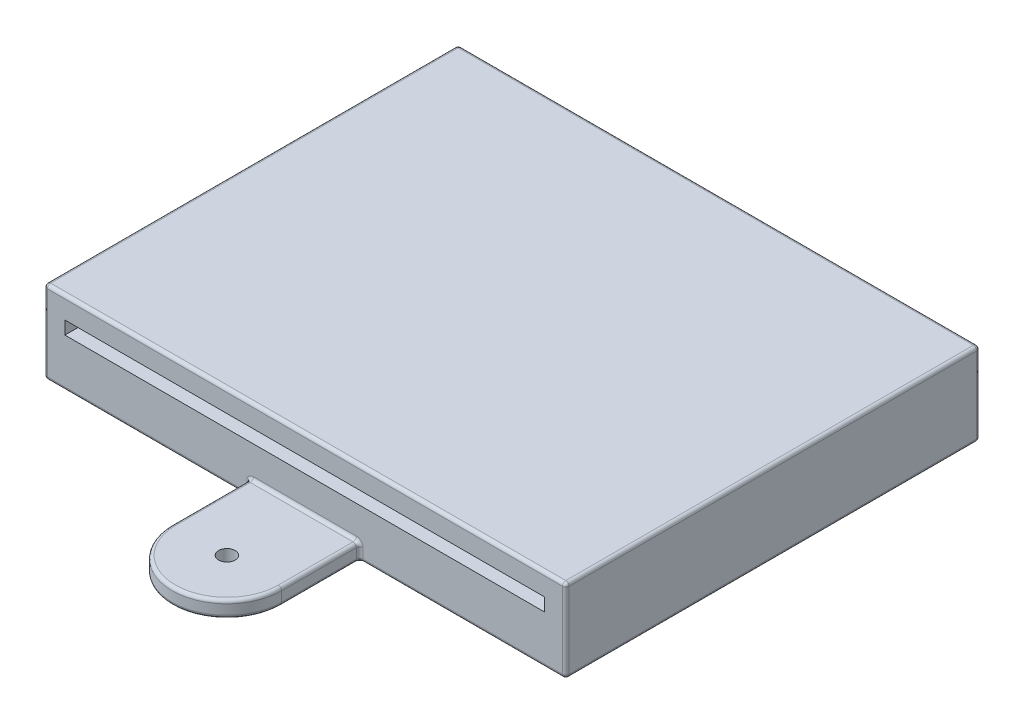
ISO-10303-21;
HEADER;
FILE_DESCRIPTION(('STEP AP214'),'2;1');
FILE_NAME('part.step','',(''),(''),'','','');
FILE_SCHEMA(('AUTOMOTIVE_DESIGN { 1 0 10303 214 1 1 1 1 }'));
ENDSEC;
DATA;
#1=APPLICATION_CONTEXT('core data for automotive mechanical design processes');
#2=APPLICATION_PROTOCOL_DEFINITION('international standard','automotive_design',2000,#1);
#3=PRODUCT_CONTEXT('',#1,'mechanical');
#4=PRODUCT('Part','Part','',(#3));
#5=PRODUCT_RELATED_PRODUCT_CATEGORY('part','',(#4));
#6=PRODUCT_DEFINITION_FORMATION('','',#4);
#7=PRODUCT_DEFINITION_CONTEXT('part definition',#1,'design');
#8=PRODUCT_DEFINITION('design','',#6,#7);
#9=PRODUCT_DEFINITION_SHAPE('','',#8);
#10=(LENGTH_UNIT() NAMED_UNIT(*) SI_UNIT(.MILLI.,.METRE.));
#11=(NAMED_UNIT(*) PLANE_ANGLE_UNIT() SI_UNIT($,.RADIAN.));
#12=(NAMED_UNIT(*) SI_UNIT($,.STERADIAN.) SOLID_ANGLE_UNIT());
#13=UNCERTAINTY_MEASURE_WITH_UNIT(LENGTH_MEASURE(1.E-05),#10,'distance_accuracy_value','');
#14=(GEOMETRIC_REPRESENTATION_CONTEXT(3) GLOBAL_UNCERTAINTY_ASSIGNED_CONTEXT((#13)) GLOBAL_UNIT_ASSIGNED_CONTEXT((#10,
#11,#12)) REPRESENTATION_CONTEXT('',''));
#15=CARTESIAN_POINT('',(0.,0.,0.));
#16=DIRECTION('',(0.,0.,1.));
#17=DIRECTION('',(1.,0.,0.));
#18=AXIS2_PLACEMENT_3D('',#15,#16,#17);
#19=CARTESIAN_POINT('',(-400.,127.,317.5));
#20=DIRECTION('',(0.,0.,-1.));
#21=DIRECTION('',(-1.,0.,0.));
#22=AXIS2_PLACEMENT_3D('',#19,#20,#21);
#23=PLANE('',#22);
#24=DIRECTION('',(0.,-1.,0.));
#25=VECTOR('',#24,1.);
#26=CARTESIAN_POINT('',(89.0769273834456,127.,317.5));
#27=LINE('',#26,#25);
#28=CARTESIAN_POINT('',(89.0769273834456,20.32,317.5));
#29=VERTEX_POINT('',#28);
#30=CARTESIAN_POINT('',(89.0769273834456,5.08,317.5));
#31=VERTEX_POINT('',#30);
#32=EDGE_CURVE('E287',#29,#31,#27,.T.);
#33=ORIENTED_EDGE('',*,*,#32,.T.);
#34=DIRECTION('',(1.,0.,0.));
#35=VECTOR('',#34,1.);
#36=CARTESIAN_POINT('',(400.,5.08,317.5));
#37=LINE('',#36,#35);
#38=CARTESIAN_POINT('',(394.92,5.08,317.5));
#39=VERTEX_POINT('',#38);
#40=EDGE_CURVE('E290',#31,#39,#37,.T.);
#41=ORIENTED_EDGE('',*,*,#40,.T.);
#42=DIRECTION('',(0.,-1.,0.));
#43=VECTOR('',#42,1.);
#44=CARTESIAN_POINT('',(394.92,127.,317.5));
#45=LINE('',#44,#43);
#46=CARTESIAN_POINT('',(394.92,121.92,317.5));
#47=VERTEX_POINT('',#46);
#48=EDGE_CURVE('E282',#39,#47,#45,.F.);
#49=ORIENTED_EDGE('',*,*,#48,.T.);
#50=DIRECTION('',(1.,0.,0.));
#51=VECTOR('',#50,1.);
#52=CARTESIAN_POINT('',(-400.,121.92,317.5));
#53=LINE('',#52,#51);
#54=CARTESIAN_POINT('',(-394.92,121.92,317.5));
#55=VERTEX_POINT('',#54);
#56=EDGE_CURVE('E278',#47,#55,#53,.F.);
#57=ORIENTED_EDGE('',*,*,#56,.T.);
#58=DIRECTION('',(0.,-1.,0.));
#59=VECTOR('',#58,1.);
#60=CARTESIAN_POINT('',(-394.92,127.,317.5));
#61=LINE('',#60,#59);
#62=CARTESIAN_POINT('',(-394.92,5.08,317.5));
#63=VERTEX_POINT('',#62);
#64=EDGE_CURVE('E276',#55,#63,#61,.T.);
#65=ORIENTED_EDGE('',*,*,#64,.T.);
#66=DIRECTION('',(1.,0.,0.));
#67=VECTOR('',#66,1.);
#68=CARTESIAN_POINT('',(-83.9969273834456,5.08,317.5));
#69=LINE('',#68,#67);
#70=CARTESIAN_POINT('',(-89.0769273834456,5.08,317.5));
#71=VERTEX_POINT('',#70);
#72=EDGE_CURVE('E274',#63,#71,#69,.T.);
#73=ORIENTED_EDGE('',*,*,#72,.T.);
#74=DIRECTION('',(0.,-1.,0.));
#75=VECTOR('',#74,1.);
#76=CARTESIAN_POINT('',(-89.0769273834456,127.,317.5));
#77=LINE('',#76,#75);
#78=CARTESIAN_POINT('',(-89.0769273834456,20.32,317.5));
#79=VERTEX_POINT('',#78);
#80=EDGE_CURVE('E272',#71,#79,#77,.F.);
#81=ORIENTED_EDGE('',*,*,#80,.T.);
#82=CARTESIAN_POINT('',(-78.9169273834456,20.32,317.5));
#83=DIRECTION('',(0.,0.,-1.));
#84=DIRECTION('',(-1.,0.,0.));
#85=AXIS2_PLACEMENT_3D('',#82,#83,#84);
#86=CIRCLE('',#85,10.16);
#87=CARTESIAN_POINT('',(-78.9169273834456,30.48,317.5));
#88=VERTEX_POINT('',#87);
#89=EDGE_CURVE('E264',#88,#79,#86,.F.);
#90=ORIENTED_EDGE('',*,*,#89,.F.);
#91=DIRECTION('',(1.,0.,0.));
#92=VECTOR('',#91,1.);
#93=CARTESIAN_POINT('',(-400.,30.48,317.5));
#94=LINE('',#93,#92);
#95=CARTESIAN_POINT('',(78.9169273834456,30.48,317.5));
#96=VERTEX_POINT('',#95);
#97=EDGE_CURVE('E280',#88,#96,#94,.T.);
#98=ORIENTED_EDGE('',*,*,#97,.T.);
#99=CARTESIAN_POINT('',(78.9169273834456,20.32,317.5));
#100=DIRECTION('',(0.,0.,-1.));
#101=DIRECTION('',(-1.,0.,0.));
#102=AXIS2_PLACEMENT_3D('',#99,#100,#101);
#103=CIRCLE('',#102,10.16);
#104=EDGE_CURVE('E284',#29,#96,#103,.F.);
#105=ORIENTED_EDGE('',*,*,#104,.F.);
#106=EDGE_LOOP('',(#33,#41,#49,#57,#65,#73,#81,#90,#98,#105));
#107=FACE_BOUND('',#106,.T.);
#108=DIRECTION('',(1.,0.,0.));
#109=VECTOR('',#108,1.);
#110=CARTESIAN_POINT('',(-368.,74.,317.5));
#111=LINE('',#110,#109);
#112=CARTESIAN_POINT('',(-368.,74.,317.5));
#113=VERTEX_POINT('',#112);
#114=CARTESIAN_POINT('',(367.,74.,317.5));
#115=VERTEX_POINT('',#114);
#116=EDGE_CURVE('E251',#113,#115,#111,.T.);
#117=ORIENTED_EDGE('',*,*,#116,.F.);
#118=DIRECTION('',(0.,-1.,0.));
#119=VECTOR('',#118,1.);
#120=CARTESIAN_POINT('',(-368.,94.,317.5));
#121=LINE('',#120,#119);
#122=CARTESIAN_POINT('',(-368.,94.,317.5));
#123=VERTEX_POINT('',#122);
#124=EDGE_CURVE('E225',#123,#113,#121,.T.);
#125=ORIENTED_EDGE('',*,*,#124,.F.);
#126=DIRECTION('',(-1.,0.,0.));
#127=VECTOR('',#126,1.);
#128=CARTESIAN_POINT('',(-368.,94.,317.5));
#129=LINE('',#128,#127);
#130=CARTESIAN_POINT('',(367.,94.,317.5));
#131=VERTEX_POINT('',#130);
#132=EDGE_CURVE('E242',#131,#123,#129,.T.);
#133=ORIENTED_EDGE('',*,*,#132,.F.);
#134=DIRECTION('',(0.,1.,0.));
#135=VECTOR('',#134,1.);
#136=CARTESIAN_POINT('',(367.,94.,317.5));
#137=LINE('',#136,#135);
#138=EDGE_CURVE('E245',#115,#131,#137,.T.);
#139=ORIENTED_EDGE('',*,*,#138,.F.);
#140=EDGE_LOOP('',(#117,#125,#133,#139));
#141=FACE_BOUND('',#140,.T.);
#142=ADVANCED_FACE('F33',(#107,#141),#23,.F.);
#143=CARTESIAN_POINT('',(-400.,127.,317.5));
#144=DIRECTION('',(1.,0.,0.));
#145=DIRECTION('',(0.,0.,-1.));
#146=AXIS2_PLACEMENT_3D('',#143,#144,#145);
#147=PLANE('',#146);
#148=DIRECTION('',(0.,0.,1.));
#149=VECTOR('',#148,1.);
#150=CARTESIAN_POINT('',(-400.,121.92,317.5));
#151=LINE('',#150,#149);
#152=CARTESIAN_POINT('',(-400.,121.92,312.42));
#153=VERTEX_POINT('',#152);
#154=CARTESIAN_POINT('',(-400.,121.92,-312.42));
#155=VERTEX_POINT('',#154);
#156=EDGE_CURVE('E345',#153,#155,#151,.F.);
#157=ORIENTED_EDGE('',*,*,#156,.T.);
#158=DIRECTION('',(0.,-1.,0.));
#159=VECTOR('',#158,1.);
#160=CARTESIAN_POINT('',(-400.,127.,-312.42));
#161=LINE('',#160,#159);
#162=CARTESIAN_POINT('',(-400.,5.08,-312.42));
#163=VERTEX_POINT('',#162);
#164=EDGE_CURVE('E347',#155,#163,#161,.T.);
#165=ORIENTED_EDGE('',*,*,#164,.T.);
#166=DIRECTION('',(0.,0.,1.));
#167=VECTOR('',#166,1.);
#168=CARTESIAN_POINT('',(-400.,5.08,317.5));
#169=LINE('',#168,#167);
#170=CARTESIAN_POINT('',(-400.,5.08,312.42));
#171=VERTEX_POINT('',#170);
#172=EDGE_CURVE('E341',#163,#171,#169,.T.);
#173=ORIENTED_EDGE('',*,*,#172,.T.);
#174=DIRECTION('',(0.,-1.,0.));
#175=VECTOR('',#174,1.);
#176=CARTESIAN_POINT('',(-400.,127.,312.42));
#177=LINE('',#176,#175);
#178=EDGE_CURVE('E343',#171,#153,#177,.F.);
#179=ORIENTED_EDGE('',*,*,#178,.T.);
#180=EDGE_LOOP('',(#157,#165,#173,#179));
#181=FACE_BOUND('',#180,.T.);
#182=ADVANCED_FACE('F506',(#181),#147,.F.);
#183=CARTESIAN_POINT('',(400.,127.,317.5));
#184=DIRECTION('',(-1.,0.,0.));
#185=DIRECTION('',(0.,0.,1.));
#186=AXIS2_PLACEMENT_3D('',#183,#184,#185);
#187=PLANE('',#186);
#188=DIRECTION('',(0.,0.,-1.));
#189=VECTOR('',#188,1.);
#190=CARTESIAN_POINT('',(400.,121.92,317.5));
#191=LINE('',#190,#189);
#192=CARTESIAN_POINT('',(400.,121.92,-312.42));
#193=VERTEX_POINT('',#192);
#194=CARTESIAN_POINT('',(400.,121.92,312.42));
#195=VERTEX_POINT('',#194);
#196=EDGE_CURVE('E336',#193,#195,#191,.F.);
#197=ORIENTED_EDGE('',*,*,#196,.T.);
#198=DIRECTION('',(0.,-1.,0.));
#199=VECTOR('',#198,1.);
#200=CARTESIAN_POINT('',(400.,127.,312.42));
#201=LINE('',#200,#199);
#202=CARTESIAN_POINT('',(400.,5.08,312.42));
#203=VERTEX_POINT('',#202);
#204=EDGE_CURVE('E338',#195,#203,#201,.T.);
#205=ORIENTED_EDGE('',*,*,#204,.T.);
#206=DIRECTION('',(0.,0.,-1.));
#207=VECTOR('',#206,1.);
#208=CARTESIAN_POINT('',(400.,5.08,-317.5));
#209=LINE('',#208,#207);
#210=CARTESIAN_POINT('',(400.,5.08,-312.42));
#211=VERTEX_POINT('',#210);
#212=EDGE_CURVE('E332',#203,#211,#209,.T.);
#213=ORIENTED_EDGE('',*,*,#212,.T.);
#214=DIRECTION('',(0.,-1.,0.));
#215=VECTOR('',#214,1.);
#216=CARTESIAN_POINT('',(400.,127.,-312.42));
#217=LINE('',#216,#215);
#218=EDGE_CURVE('E334',#211,#193,#217,.F.);
#219=ORIENTED_EDGE('',*,*,#218,.T.);
#220=EDGE_LOOP('',(#197,#205,#213,#219));
#221=FACE_BOUND('',#220,.T.);
#222=ADVANCED_FACE('F553',(#221),#187,.F.);
#223=CARTESIAN_POINT('',(-400.,127.,-317.5));
#224=DIRECTION('',(0.,0.,1.));
#225=DIRECTION('',(1.,0.,0.));
#226=AXIS2_PLACEMENT_3D('',#223,#224,#225);
#227=PLANE('',#226);
#228=DIRECTION('',(0.,-1.,0.));
#229=VECTOR('',#228,1.);
#230=CARTESIAN_POINT('',(-394.92,127.,-317.5));
#231=LINE('',#230,#229);
#232=CARTESIAN_POINT('',(-394.92,5.08,-317.5));
#233=VERTEX_POINT('',#232);
#234=CARTESIAN_POINT('',(-394.92,121.92,-317.5));
#235=VERTEX_POINT('',#234);
#236=EDGE_CURVE('E325',#233,#235,#231,.F.);
#237=ORIENTED_EDGE('',*,*,#236,.T.);
#238=DIRECTION('',(-1.,0.,0.));
#239=VECTOR('',#238,1.);
#240=CARTESIAN_POINT('',(-400.,121.92,-317.5));
#241=LINE('',#240,#239);
#242=CARTESIAN_POINT('',(394.92,121.92,-317.5));
#243=VERTEX_POINT('',#242);
#244=EDGE_CURVE('E329',#235,#243,#241,.F.);
#245=ORIENTED_EDGE('',*,*,#244,.T.);
#246=DIRECTION('',(0.,-1.,0.));
#247=VECTOR('',#246,1.);
#248=CARTESIAN_POINT('',(394.92,127.,-317.5));
#249=LINE('',#248,#247);
#250=CARTESIAN_POINT('',(394.92,5.08,-317.5));
#251=VERTEX_POINT('',#250);
#252=EDGE_CURVE('E327',#243,#251,#249,.T.);
#253=ORIENTED_EDGE('',*,*,#252,.T.);
#254=DIRECTION('',(-1.,0.,0.));
#255=VECTOR('',#254,1.);
#256=CARTESIAN_POINT('',(-400.,5.08,-317.5));
#257=LINE('',#256,#255);
#258=EDGE_CURVE('E323',#251,#233,#257,.T.);
#259=ORIENTED_EDGE('',*,*,#258,.T.);
#260=EDGE_LOOP('',(#237,#245,#253,#259));
#261=FACE_BOUND('',#260,.T.);
#262=ADVANCED_FACE('F562',(#261),#227,.F.);
#263=CARTESIAN_POINT('',(-400.,127.,-317.5));
#264=DIRECTION('',(0.,-1.,0.));
#265=DIRECTION('',(0.,0.,-1.));
#266=AXIS2_PLACEMENT_3D('',#263,#264,#265);
#267=PLANE('',#266);
#268=DIRECTION('',(1.,0.,0.));
#269=VECTOR('',#268,1.);
#270=CARTESIAN_POINT('',(-400.,127.,312.42));
#271=LINE('',#270,#269);
#272=CARTESIAN_POINT('',(-394.92,127.,312.42));
#273=VERTEX_POINT('',#272);
#274=CARTESIAN_POINT('',(394.92,127.,312.42));
#275=VERTEX_POINT('',#274);
#276=EDGE_CURVE('E318',#273,#275,#271,.T.);
#277=ORIENTED_EDGE('',*,*,#276,.T.);
#278=DIRECTION('',(0.,0.,-1.));
#279=VECTOR('',#278,1.);
#280=CARTESIAN_POINT('',(394.92,127.,-317.5));
#281=LINE('',#280,#279);
#282=CARTESIAN_POINT('',(394.92,127.,-312.42));
#283=VERTEX_POINT('',#282);
#284=EDGE_CURVE('E321',#275,#283,#281,.T.);
#285=ORIENTED_EDGE('',*,*,#284,.T.);
#286=DIRECTION('',(-1.,0.,0.));
#287=VECTOR('',#286,1.);
#288=CARTESIAN_POINT('',(-400.,127.,-312.42));
#289=LINE('',#288,#287);
#290=CARTESIAN_POINT('',(-394.92,127.,-312.42));
#291=VERTEX_POINT('',#290);
#292=EDGE_CURVE('E316',#283,#291,#289,.T.);
#293=ORIENTED_EDGE('',*,*,#292,.T.);
#294=DIRECTION('',(0.,0.,1.));
#295=VECTOR('',#294,1.);
#296=CARTESIAN_POINT('',(-394.92,127.,-317.5));
#297=LINE('',#296,#295);
#298=EDGE_CURVE('E314',#291,#273,#297,.T.);
#299=ORIENTED_EDGE('',*,*,#298,.T.);
#300=EDGE_LOOP('',(#277,#285,#293,#299));
#301=FACE_BOUND('',#300,.T.);
#302=ADVANCED_FACE('F540',(#301),#267,.F.);
#303=CARTESIAN_POINT('',(-400.,0.,-317.5));
#304=DIRECTION('',(0.,-1.,0.));
#305=DIRECTION('',(0.,0.,-1.));
#306=AXIS2_PLACEMENT_3D('',#303,#304,#305);
#307=PLANE('',#306);
#308=CARTESIAN_POINT('',(0.,0.,437.134));
#309=DIRECTION('',(0.,-1.,0.));
#310=DIRECTION('',(0.,0.,-1.));
#311=AXIS2_PLACEMENT_3D('',#308,#309,#310);
#312=CIRCLE('',#311,78.9169273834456);
#313=CARTESIAN_POINT('',(78.9169273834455,0.,437.134));
#314=VERTEX_POINT('',#313);
#315=CARTESIAN_POINT('',(-78.9169273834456,0.,437.134));
#316=VERTEX_POINT('',#315);
#317=EDGE_CURVE('E55',#314,#316,#312,.T.);
#318=ORIENTED_EDGE('',*,*,#317,.T.);
#319=DIRECTION('',(0.,0.,-1.));
#320=VECTOR('',#319,1.);
#321=CARTESIAN_POINT('',(-78.9169273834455,0.,-317.5));
#322=LINE('',#321,#320);
#323=CARTESIAN_POINT('',(-78.9169273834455,0.,322.58));
#324=VERTEX_POINT('',#323);
#325=EDGE_CURVE('E50',#316,#324,#322,.T.);
#326=ORIENTED_EDGE('',*,*,#325,.T.);
#327=CARTESIAN_POINT('',(-89.0769273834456,0.,322.58));
#328=DIRECTION('',(0.,-1.,0.));
#329=DIRECTION('',(0.,0.,-1.));
#330=AXIS2_PLACEMENT_3D('',#327,#328,#329);
#331=CIRCLE('',#330,10.16);
#332=CARTESIAN_POINT('',(-89.0769273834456,0.,312.42));
#333=VERTEX_POINT('',#332);
#334=EDGE_CURVE('E370',#333,#324,#331,.T.);
#335=ORIENTED_EDGE('',*,*,#334,.F.);
#336=DIRECTION('',(1.,0.,0.));
#337=VECTOR('',#336,1.);
#338=CARTESIAN_POINT('',(-400.,0.,312.42));
#339=LINE('',#338,#337);
#340=CARTESIAN_POINT('',(-394.92,0.,312.42));
#341=VERTEX_POINT('',#340);
#342=EDGE_CURVE('E361',#333,#341,#339,.F.);
#343=ORIENTED_EDGE('',*,*,#342,.T.);
#344=DIRECTION('',(0.,0.,1.));
#345=VECTOR('',#344,1.);
#346=CARTESIAN_POINT('',(-394.92,0.,-317.5));
#347=LINE('',#346,#345);
#348=CARTESIAN_POINT('',(-394.92,0.,-312.42));
#349=VERTEX_POINT('',#348);
#350=EDGE_CURVE('E353',#341,#349,#347,.F.);
#351=ORIENTED_EDGE('',*,*,#350,.T.);
#352=DIRECTION('',(-1.,0.,0.));
#353=VECTOR('',#352,1.);
#354=CARTESIAN_POINT('',(400.,0.,-312.42));
#355=LINE('',#354,#353);
#356=CARTESIAN_POINT('',(394.92,0.,-312.42));
#357=VERTEX_POINT('',#356);
#358=EDGE_CURVE('E355',#349,#357,#355,.F.);
#359=ORIENTED_EDGE('',*,*,#358,.T.);
#360=DIRECTION('',(0.,0.,-1.));
#361=VECTOR('',#360,1.);
#362=CARTESIAN_POINT('',(394.92,0.,317.5));
#363=LINE('',#362,#361);
#364=CARTESIAN_POINT('',(394.92,0.,312.42));
#365=VERTEX_POINT('',#364);
#366=EDGE_CURVE('E357',#357,#365,#363,.F.);
#367=ORIENTED_EDGE('',*,*,#366,.T.);
#368=DIRECTION('',(1.,0.,0.));
#369=VECTOR('',#368,1.);
#370=CARTESIAN_POINT('',(83.9969273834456,0.,312.42));
#371=LINE('',#370,#369);
#372=CARTESIAN_POINT('',(89.0769273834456,0.,312.42));
#373=VERTEX_POINT('',#372);
#374=EDGE_CURVE('E359',#365,#373,#371,.F.);
#375=ORIENTED_EDGE('',*,*,#374,.T.);
#376=CARTESIAN_POINT('',(89.0769273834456,0.,322.58));
#377=DIRECTION('',(0.,-1.,0.));
#378=DIRECTION('',(0.,0.,-1.));
#379=AXIS2_PLACEMENT_3D('',#376,#377,#378);
#380=CIRCLE('',#379,10.16);
#381=CARTESIAN_POINT('',(78.9169273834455,0.,322.58));
#382=VERTEX_POINT('',#381);
#383=EDGE_CURVE('E364',#382,#373,#380,.T.);
#384=ORIENTED_EDGE('',*,*,#383,.F.);
#385=DIRECTION('',(0.,0.,1.));
#386=VECTOR('',#385,1.);
#387=CARTESIAN_POINT('',(78.9169273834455,0.,-317.5));
#388=LINE('',#387,#386);
#389=EDGE_CURVE('E367',#382,#314,#388,.T.);
#390=ORIENTED_EDGE('',*,*,#389,.T.);
#391=EDGE_LOOP('',(#318,#326,#335,#343,#351,#359,#367,#375,#384,#390));
#392=FACE_BOUND('',#391,.T.);
#393=CARTESIAN_POINT('',(0.,0.,437.134));
#394=DIRECTION('',(0.,-1.,0.));
#395=DIRECTION('',(0.,0.,-1.));
#396=AXIS2_PLACEMENT_3D('',#393,#394,#395);
#397=CIRCLE('',#396,17.78);
#398=CARTESIAN_POINT('',(0.,0.,419.354));
#399=VERTEX_POINT('',#398);
#400=EDGE_CURVE('E350',#399,#399,#397,.F.);
#401=ORIENTED_EDGE('',*,*,#400,.T.);
#402=EDGE_LOOP('',(#401));
#403=FACE_BOUND('',#402,.T.);
#404=ADVANCED_FACE('F974',(#392,#403),#307,.T.);
#405=CARTESIAN_POINT('',(-83.9969273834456,25.4,317.5));
#406=DIRECTION('',(-1.,0.,0.));
#407=DIRECTION('',(0.,0.,1.));
#408=AXIS2_PLACEMENT_3D('',#405,#406,#407);
#409=PLANE('',#408);
#410=DIRECTION('',(0.,-1.,0.));
#411=VECTOR('',#410,1.);
#412=CARTESIAN_POINT('',(-83.9969273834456,25.4,437.134));
#413=LINE('',#412,#411);
#414=CARTESIAN_POINT('',(-83.9969273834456,20.32,437.134));
#415=VERTEX_POINT('',#414);
#416=CARTESIAN_POINT('',(-83.9969273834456,5.08,437.134));
#417=VERTEX_POINT('',#416);
#418=EDGE_CURVE('E261',#415,#417,#413,.T.);
#419=ORIENTED_EDGE('',*,*,#418,.F.);
#420=DIRECTION('',(0.,0.,-1.));
#421=VECTOR('',#420,1.);
#422=CARTESIAN_POINT('',(-83.9969273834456,20.32,317.5));
#423=LINE('',#422,#421);
#424=CARTESIAN_POINT('',(-83.9969273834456,20.32,322.58));
#425=VERTEX_POINT('',#424);
#426=EDGE_CURVE('E312',#415,#425,#423,.T.);
#427=ORIENTED_EDGE('',*,*,#426,.T.);
#428=DIRECTION('',(0.,-1.,0.));
#429=VECTOR('',#428,1.);
#430=CARTESIAN_POINT('',(-83.9969273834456,25.4,322.58));
#431=LINE('',#430,#429);
#432=CARTESIAN_POINT('',(-83.9969273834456,5.08,322.58));
#433=VERTEX_POINT('',#432);
#434=EDGE_CURVE('E308',#425,#433,#431,.T.);
#435=ORIENTED_EDGE('',*,*,#434,.T.);
#436=DIRECTION('',(0.,0.,-1.));
#437=VECTOR('',#436,1.);
#438=CARTESIAN_POINT('',(-83.9969273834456,5.08,317.5));
#439=LINE('',#438,#437);
#440=EDGE_CURVE('E310',#433,#417,#439,.F.);
#441=ORIENTED_EDGE('',*,*,#440,.T.);
#442=EDGE_LOOP('',(#419,#427,#435,#441));
#443=FACE_BOUND('',#442,.T.);
#444=ADVANCED_FACE('F965',(#443),#409,.T.);
#445=CARTESIAN_POINT('',(0.,25.4,437.134));
#446=DIRECTION('',(0.,-1.,0.));
#447=DIRECTION('',(0.,0.,-1.));
#448=AXIS2_PLACEMENT_3D('',#445,#446,#447);
#449=CYLINDRICAL_SURFACE('',#448,83.9969273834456);
#450=ORIENTED_EDGE('',*,*,#418,.T.);
#451=CARTESIAN_POINT('',(0.,5.08,437.134));
#452=DIRECTION('',(0.,-1.,0.));
#453=DIRECTION('',(0.,0.,-1.));
#454=AXIS2_PLACEMENT_3D('',#451,#452,#453);
#455=CIRCLE('',#454,83.9969273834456);
#456=CARTESIAN_POINT('',(83.9969273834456,5.08,437.134));
#457=VERTEX_POINT('',#456);
#458=EDGE_CURVE('E42',#417,#457,#455,.F.);
#459=ORIENTED_EDGE('',*,*,#458,.T.);
#460=DIRECTION('',(0.,-1.,0.));
#461=VECTOR('',#460,1.);
#462=CARTESIAN_POINT('',(83.9969273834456,25.4,437.134));
#463=LINE('',#462,#461);
#464=CARTESIAN_POINT('',(83.9969273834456,20.32,437.134));
#465=VERTEX_POINT('',#464);
#466=EDGE_CURVE('E265',#465,#457,#463,.T.);
#467=ORIENTED_EDGE('',*,*,#466,.F.);
#468=CARTESIAN_POINT('',(0.,20.32,437.134));
#469=DIRECTION('',(0.,1.,0.));
#470=DIRECTION('',(0.,0.,1.));
#471=AXIS2_PLACEMENT_3D('',#468,#469,#470);
#472=CIRCLE('',#471,83.9969273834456);
#473=EDGE_CURVE('E373',#465,#415,#472,.F.);
#474=ORIENTED_EDGE('',*,*,#473,.T.);
#475=EDGE_LOOP('',(#450,#459,#467,#474));
#476=FACE_BOUND('',#475,.T.);
#477=ADVANCED_FACE('F956',(#476),#449,.T.);
#478=CARTESIAN_POINT('',(83.9969273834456,25.4,437.134));
#479=DIRECTION('',(1.,0.,0.));
#480=DIRECTION('',(0.,0.,-1.));
#481=AXIS2_PLACEMENT_3D('',#478,#479,#480);
#482=PLANE('',#481);
#483=DIRECTION('',(0.,-1.,0.));
#484=VECTOR('',#483,1.);
#485=CARTESIAN_POINT('',(83.9969273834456,25.4,322.58));
#486=LINE('',#485,#484);
#487=CARTESIAN_POINT('',(83.9969273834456,5.08,322.58));
#488=VERTEX_POINT('',#487);
#489=CARTESIAN_POINT('',(83.9969273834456,20.32,322.58));
#490=VERTEX_POINT('',#489);
#491=EDGE_CURVE('E294',#488,#490,#486,.F.);
#492=ORIENTED_EDGE('',*,*,#491,.T.);
#493=DIRECTION('',(0.,0.,1.));
#494=VECTOR('',#493,1.);
#495=CARTESIAN_POINT('',(83.9969273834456,20.32,437.134));
#496=LINE('',#495,#494);
#497=EDGE_CURVE('E297',#490,#465,#496,.T.);
#498=ORIENTED_EDGE('',*,*,#497,.T.);
#499=ORIENTED_EDGE('',*,*,#466,.T.);
#500=DIRECTION('',(0.,0.,1.));
#501=VECTOR('',#500,1.);
#502=CARTESIAN_POINT('',(83.9969273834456,5.08,437.134));
#503=LINE('',#502,#501);
#504=EDGE_CURVE('E292',#457,#488,#503,.F.);
#505=ORIENTED_EDGE('',*,*,#504,.T.);
#506=EDGE_LOOP('',(#492,#498,#499,#505));
#507=FACE_BOUND('',#506,.T.);
#508=ADVANCED_FACE('F947',(#507),#482,.T.);
#509=CARTESIAN_POINT('',(0.,25.4,437.134));
#510=DIRECTION('',(0.,1.,0.));
#511=DIRECTION('',(0.,0.,1.));
#512=AXIS2_PLACEMENT_3D('',#509,#510,#511);
#513=PLANE('',#512);
#514=DIRECTION('',(0.,0.,1.));
#515=VECTOR('',#514,1.);
#516=CARTESIAN_POINT('',(78.9169273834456,25.4,437.134));
#517=LINE('',#516,#515);
#518=CARTESIAN_POINT('',(78.9169273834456,25.4,437.134));
#519=VERTEX_POINT('',#518);
#520=CARTESIAN_POINT('',(78.9169273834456,25.4,322.58));
#521=VERTEX_POINT('',#520);
#522=EDGE_CURVE('E303',#519,#521,#517,.F.);
#523=ORIENTED_EDGE('',*,*,#522,.T.);
#524=DIRECTION('',(1.,0.,0.));
#525=VECTOR('',#524,1.);
#526=CARTESIAN_POINT('',(0.,25.4,322.58));
#527=LINE('',#526,#525);
#528=CARTESIAN_POINT('',(-78.9169273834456,25.4,322.58));
#529=VERTEX_POINT('',#528);
#530=EDGE_CURVE('E305',#521,#529,#527,.F.);
#531=ORIENTED_EDGE('',*,*,#530,.T.);
#532=DIRECTION('',(0.,0.,-1.));
#533=VECTOR('',#532,1.);
#534=CARTESIAN_POINT('',(-78.9169273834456,25.4,437.134));
#535=LINE('',#534,#533);
#536=CARTESIAN_POINT('',(-78.9169273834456,25.4,437.134));
#537=VERTEX_POINT('',#536);
#538=EDGE_CURVE('E301',#529,#537,#535,.F.);
#539=ORIENTED_EDGE('',*,*,#538,.T.);
#540=CARTESIAN_POINT('',(0.,25.4,437.134));
#541=DIRECTION('',(0.,1.,0.));
#542=DIRECTION('',(0.,0.,1.));
#543=AXIS2_PLACEMENT_3D('',#540,#541,#542);
#544=CIRCLE('',#543,78.9169273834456);
#545=EDGE_CURVE('E299',#537,#519,#544,.T.);
#546=ORIENTED_EDGE('',*,*,#545,.T.);
#547=EDGE_LOOP('',(#523,#531,#539,#546));
#548=FACE_BOUND('',#547,.T.);
#549=CARTESIAN_POINT('',(0.,25.4,437.134));
#550=DIRECTION('',(0.,1.,0.));
#551=DIRECTION('',(0.,0.,1.));
#552=AXIS2_PLACEMENT_3D('',#549,#550,#551);
#553=CIRCLE('',#552,12.7);
#554=CARTESIAN_POINT('',(0.,25.4,449.834));
#555=VERTEX_POINT('',#554);
#556=EDGE_CURVE('E257',#555,#555,#553,.T.);
#557=ORIENTED_EDGE('',*,*,#556,.F.);
#558=EDGE_LOOP('',(#557));
#559=FACE_BOUND('',#558,.T.);
#560=ADVANCED_FACE('F938',(#548,#559),#513,.T.);
#561=CARTESIAN_POINT('',(0.,127.,437.134));
#562=DIRECTION('',(0.,-1.,0.));
#563=DIRECTION('',(0.,0.,-1.));
#564=AXIS2_PLACEMENT_3D('',#561,#562,#563);
#565=CYLINDRICAL_SURFACE('',#564,12.7);
#566=CARTESIAN_POINT('',(0.,5.08,437.134));
#567=DIRECTION('',(0.,-1.,0.));
#568=DIRECTION('',(0.,0.,-1.));
#569=AXIS2_PLACEMENT_3D('',#566,#567,#568);
#570=CIRCLE('',#569,12.7);
#571=CARTESIAN_POINT('',(0.,5.08,424.434));
#572=VERTEX_POINT('',#571);
#573=EDGE_CURVE('E11',#572,#572,#570,.T.);
#574=ORIENTED_EDGE('',*,*,#573,.T.);
#575=EDGE_LOOP('',(#574));
#576=FACE_BOUND('',#575,.T.);
#577=ORIENTED_EDGE('',*,*,#556,.T.);
#578=EDGE_LOOP('',(#577));
#579=FACE_BOUND('',#578,.T.);
#580=ADVANCED_FACE('F931',(#576,#579),#565,.F.);
#581=CARTESIAN_POINT('',(-368.,94.,241.3));
#582=DIRECTION('',(-1.,0.,0.));
#583=DIRECTION('',(0.,0.,1.));
#584=AXIS2_PLACEMENT_3D('',#581,#582,#583);
#585=PLANE('',#584);
#586=ORIENTED_EDGE('',*,*,#124,.T.);
#587=DIRECTION('',(0.,0.,1.));
#588=VECTOR('',#587,1.);
#589=CARTESIAN_POINT('',(-368.,74.,241.3));
#590=LINE('',#589,#588);
#591=CARTESIAN_POINT('',(-368.,74.,241.3));
#592=VERTEX_POINT('',#591);
#593=EDGE_CURVE('E218',#592,#113,#590,.T.);
#594=ORIENTED_EDGE('',*,*,#593,.F.);
#595=DIRECTION('',(0.,-1.,0.));
#596=VECTOR('',#595,1.);
#597=CARTESIAN_POINT('',(-368.,94.,241.3));
#598=LINE('',#597,#596);
#599=CARTESIAN_POINT('',(-368.,94.,241.3));
#600=VERTEX_POINT('',#599);
#601=EDGE_CURVE('E222',#600,#592,#598,.T.);
#602=ORIENTED_EDGE('',*,*,#601,.F.);
#603=DIRECTION('',(0.,0.,1.));
#604=VECTOR('',#603,1.);
#605=CARTESIAN_POINT('',(-368.,94.,241.3));
#606=LINE('',#605,#604);
#607=EDGE_CURVE('E255',#600,#123,#606,.T.);
#608=ORIENTED_EDGE('',*,*,#607,.T.);
#609=EDGE_LOOP('',(#586,#594,#602,#608));
#610=FACE_BOUND('',#609,.T.);
#611=ADVANCED_FACE('F220',(#610),#585,.F.);
#612=CARTESIAN_POINT('',(-368.,94.,241.3));
#613=DIRECTION('',(0.,1.,0.));
#614=DIRECTION('',(0.,0.,1.));
#615=AXIS2_PLACEMENT_3D('',#612,#613,#614);
#616=PLANE('',#615);
#617=ORIENTED_EDGE('',*,*,#132,.T.);
#618=ORIENTED_EDGE('',*,*,#607,.F.);
#619=DIRECTION('',(-1.,0.,0.));
#620=VECTOR('',#619,1.);
#621=CARTESIAN_POINT('',(-368.,94.,241.3));
#622=LINE('',#621,#620);
#623=CARTESIAN_POINT('',(367.,94.,241.3));
#624=VERTEX_POINT('',#623);
#625=EDGE_CURVE('E230',#624,#600,#622,.T.);
#626=ORIENTED_EDGE('',*,*,#625,.F.);
#627=DIRECTION('',(0.,0.,1.));
#628=VECTOR('',#627,1.);
#629=CARTESIAN_POINT('',(367.,94.,241.3));
#630=LINE('',#629,#628);
#631=EDGE_CURVE('E258',#624,#131,#630,.T.);
#632=ORIENTED_EDGE('',*,*,#631,.T.);
#633=EDGE_LOOP('',(#617,#618,#626,#632));
#634=FACE_BOUND('',#633,.T.);
#635=ADVANCED_FACE('F914',(#634),#616,.F.);
#636=CARTESIAN_POINT('',(367.,94.,241.3));
#637=DIRECTION('',(1.,0.,0.));
#638=DIRECTION('',(0.,0.,-1.));
#639=AXIS2_PLACEMENT_3D('',#636,#637,#638);
#640=PLANE('',#639);
#641=ORIENTED_EDGE('',*,*,#138,.T.);
#642=ORIENTED_EDGE('',*,*,#631,.F.);
#643=DIRECTION('',(0.,1.,0.));
#644=VECTOR('',#643,1.);
#645=CARTESIAN_POINT('',(367.,94.,241.3));
#646=LINE('',#645,#644);
#647=CARTESIAN_POINT('',(367.,74.,241.3));
#648=VERTEX_POINT('',#647);
#649=EDGE_CURVE('E238',#648,#624,#646,.T.);
#650=ORIENTED_EDGE('',*,*,#649,.F.);
#651=DIRECTION('',(0.,0.,1.));
#652=VECTOR('',#651,1.);
#653=CARTESIAN_POINT('',(367.,74.,241.3));
#654=LINE('',#653,#652);
#655=EDGE_CURVE('E229',#648,#115,#654,.T.);
#656=ORIENTED_EDGE('',*,*,#655,.T.);
#657=EDGE_LOOP('',(#641,#642,#650,#656));
#658=FACE_BOUND('',#657,.T.);
#659=ADVANCED_FACE('F906',(#658),#640,.F.);
#660=CARTESIAN_POINT('',(-368.,74.,241.3));
#661=DIRECTION('',(0.,-1.,0.));
#662=DIRECTION('',(0.,0.,-1.));
#663=AXIS2_PLACEMENT_3D('',#660,#661,#662);
#664=PLANE('',#663);
#665=ORIENTED_EDGE('',*,*,#116,.T.);
#666=ORIENTED_EDGE('',*,*,#655,.F.);
#667=DIRECTION('',(1.,0.,0.));
#668=VECTOR('',#667,1.);
#669=CARTESIAN_POINT('',(-368.,74.,241.3));
#670=LINE('',#669,#668);
#671=EDGE_CURVE('E233',#592,#648,#670,.T.);
#672=ORIENTED_EDGE('',*,*,#671,.F.);
#673=ORIENTED_EDGE('',*,*,#593,.T.);
#674=EDGE_LOOP('',(#665,#666,#672,#673));
#675=FACE_BOUND('',#674,.T.);
#676=ADVANCED_FACE('F234',(#675),#664,.F.);
#677=CARTESIAN_POINT('',(-368.,74.,241.3));
#678=DIRECTION('',(0.,0.,1.));
#679=DIRECTION('',(1.,0.,0.));
#680=AXIS2_PLACEMENT_3D('',#677,#678,#679);
#681=PLANE('',#680);
#682=ORIENTED_EDGE('',*,*,#601,.T.);
#683=ORIENTED_EDGE('',*,*,#671,.T.);
#684=ORIENTED_EDGE('',*,*,#649,.T.);
#685=ORIENTED_EDGE('',*,*,#625,.T.);
#686=EDGE_LOOP('',(#682,#683,#684,#685));
#687=FACE_BOUND('',#686,.T.);
#688=ADVANCED_FACE('F240',(#687),#681,.T.);
#689=CARTESIAN_POINT('',(-394.92,121.92,-312.42));
#690=DIRECTION('',(0.,0.,1.));
#691=DIRECTION('',(1.,0.,0.));
#692=AXIS2_PLACEMENT_3D('',#689,#690,#691);
#693=SPHERICAL_SURFACE('',#692,5.08);
#694=CARTESIAN_POINT('',(-394.92,121.92,-312.42));
#695=DIRECTION('',(0.,1.,0.));
#696=DIRECTION('',(0.,0.,1.));
#697=AXIS2_PLACEMENT_3D('',#694,#695,#696);
#698=CIRCLE('',#697,5.08);
#699=EDGE_CURVE('E480',#155,#235,#698,.F.);
#700=ORIENTED_EDGE('',*,*,#699,.F.);
#701=CARTESIAN_POINT('',(-394.92,121.92,-312.42));
#702=DIRECTION('',(0.,0.,-1.));
#703=DIRECTION('',(0.,1.,0.));
#704=AXIS2_PLACEMENT_3D('',#701,#702,#703);
#705=CIRCLE('',#704,5.08);
#706=EDGE_CURVE('E37',#291,#155,#705,.F.);
#707=ORIENTED_EDGE('',*,*,#706,.F.);
#708=CARTESIAN_POINT('',(-394.92,121.92,-312.42));
#709=DIRECTION('',(-1.,0.,0.));
#710=DIRECTION('',(0.,0.,1.));
#711=AXIS2_PLACEMENT_3D('',#708,#709,#710);
#712=CIRCLE('',#711,5.08);
#713=EDGE_CURVE('E482',#235,#291,#712,.F.);
#714=ORIENTED_EDGE('',*,*,#713,.F.);
#715=EDGE_LOOP('',(#700,#707,#714));
#716=FACE_BOUND('',#715,.T.);
#717=ADVANCED_FACE('F499',(#716),#693,.T.);
#718=CARTESIAN_POINT('',(-394.92,121.92,-317.5));
#719=DIRECTION('',(0.,0.,1.));
#720=DIRECTION('',(1.,0.,0.));
#721=AXIS2_PLACEMENT_3D('',#718,#719,#720);
#722=CYLINDRICAL_SURFACE('',#721,5.08);
#723=ORIENTED_EDGE('',*,*,#706,.T.);
#724=ORIENTED_EDGE('',*,*,#156,.F.);
#725=CARTESIAN_POINT('',(-394.92,121.92,312.42));
#726=DIRECTION('',(0.,0.,1.));
#727=DIRECTION('',(1.,0.,0.));
#728=AXIS2_PLACEMENT_3D('',#725,#726,#727);
#729=CIRCLE('',#728,5.08);
#730=EDGE_CURVE('E474',#273,#153,#729,.T.);
#731=ORIENTED_EDGE('',*,*,#730,.F.);
#732=ORIENTED_EDGE('',*,*,#298,.F.);
#733=EDGE_LOOP('',(#723,#724,#731,#732));
#734=FACE_BOUND('',#733,.T.);
#735=ADVANCED_FACE('F494',(#734),#722,.T.);
#736=CARTESIAN_POINT('',(-400.,121.92,-312.42));
#737=DIRECTION('',(-1.,0.,0.));
#738=DIRECTION('',(0.,0.,1.));
#739=AXIS2_PLACEMENT_3D('',#736,#737,#738);
#740=CYLINDRICAL_SURFACE('',#739,5.08);
#741=ORIENTED_EDGE('',*,*,#713,.T.);
#742=ORIENTED_EDGE('',*,*,#292,.F.);
#743=CARTESIAN_POINT('',(394.92,121.92,-312.42));
#744=DIRECTION('',(1.,0.,0.));
#745=DIRECTION('',(0.,0.,-1.));
#746=AXIS2_PLACEMENT_3D('',#743,#744,#745);
#747=CIRCLE('',#746,5.08);
#748=EDGE_CURVE('E471',#243,#283,#747,.T.);
#749=ORIENTED_EDGE('',*,*,#748,.F.);
#750=ORIENTED_EDGE('',*,*,#244,.F.);
#751=EDGE_LOOP('',(#741,#742,#749,#750));
#752=FACE_BOUND('',#751,.T.);
#753=ADVANCED_FACE('F542',(#752),#740,.T.);
#754=CARTESIAN_POINT('',(-394.92,127.,-312.42));
#755=DIRECTION('',(0.,-1.,0.));
#756=DIRECTION('',(0.,0.,-1.));
#757=AXIS2_PLACEMENT_3D('',#754,#755,#756);
#758=CYLINDRICAL_SURFACE('',#757,5.08);
#759=ORIENTED_EDGE('',*,*,#699,.T.);
#760=ORIENTED_EDGE('',*,*,#236,.F.);
#761=CARTESIAN_POINT('',(-394.92,5.08,-312.42));
#762=DIRECTION('',(0.,-1.,0.));
#763=DIRECTION('',(0.,0.,-1.));
#764=AXIS2_PLACEMENT_3D('',#761,#762,#763);
#765=CIRCLE('',#764,5.08);
#766=EDGE_CURVE('E468',#163,#233,#765,.T.);
#767=ORIENTED_EDGE('',*,*,#766,.F.);
#768=ORIENTED_EDGE('',*,*,#164,.F.);
#769=EDGE_LOOP('',(#759,#760,#767,#768));
#770=FACE_BOUND('',#769,.T.);
#771=ADVANCED_FACE('F503',(#770),#758,.T.);
#772=CARTESIAN_POINT('',(-394.92,5.08,317.5));
#773=DIRECTION('',(0.,0.,-1.));
#774=DIRECTION('',(-1.,0.,0.));
#775=AXIS2_PLACEMENT_3D('',#772,#773,#774);
#776=CYLINDRICAL_SURFACE('',#775,5.08);
#777=CARTESIAN_POINT('',(-394.92,5.08,312.42));
#778=DIRECTION('',(0.,0.,1.));
#779=DIRECTION('',(1.,0.,0.));
#780=AXIS2_PLACEMENT_3D('',#777,#778,#779);
#781=CIRCLE('',#780,5.08);
#782=EDGE_CURVE('E463',#171,#341,#781,.T.);
#783=ORIENTED_EDGE('',*,*,#782,.F.);
#784=ORIENTED_EDGE('',*,*,#172,.F.);
#785=CARTESIAN_POINT('',(-394.92,5.08,-312.42));
#786=DIRECTION('',(0.,0.,-1.));
#787=DIRECTION('',(-1.,0.,0.));
#788=AXIS2_PLACEMENT_3D('',#785,#786,#787);
#789=CIRCLE('',#788,5.08);
#790=EDGE_CURVE('E466',#349,#163,#789,.T.);
#791=ORIENTED_EDGE('',*,*,#790,.F.);
#792=ORIENTED_EDGE('',*,*,#350,.F.);
#793=EDGE_LOOP('',(#783,#784,#791,#792));
#794=FACE_BOUND('',#793,.T.);
#795=ADVANCED_FACE('F516',(#794),#776,.T.);
#796=CARTESIAN_POINT('',(-394.92,127.,312.42));
#797=DIRECTION('',(0.,-1.,0.));
#798=DIRECTION('',(0.,0.,-1.));
#799=AXIS2_PLACEMENT_3D('',#796,#797,#798);
#800=CYLINDRICAL_SURFACE('',#799,5.08);
#801=CARTESIAN_POINT('',(-394.92,121.92,312.42));
#802=DIRECTION('',(0.,1.,0.));
#803=DIRECTION('',(0.,0.,1.));
#804=AXIS2_PLACEMENT_3D('',#801,#802,#803);
#805=CIRCLE('',#804,5.08);
#806=EDGE_CURVE('E477',#153,#55,#805,.T.);
#807=ORIENTED_EDGE('',*,*,#806,.F.);
#808=ORIENTED_EDGE('',*,*,#178,.F.);
#809=CARTESIAN_POINT('',(-394.92,5.08,312.42));
#810=DIRECTION('',(0.,-1.,0.));
#811=DIRECTION('',(0.,0.,-1.));
#812=AXIS2_PLACEMENT_3D('',#809,#810,#811);
#813=CIRCLE('',#812,5.08);
#814=EDGE_CURVE('E460',#63,#171,#813,.T.);
#815=ORIENTED_EDGE('',*,*,#814,.F.);
#816=ORIENTED_EDGE('',*,*,#64,.F.);
#817=EDGE_LOOP('',(#807,#808,#815,#816));
#818=FACE_BOUND('',#817,.T.);
#819=ADVANCED_FACE('F511',(#818),#800,.T.);
#820=CARTESIAN_POINT('',(-394.92,121.92,312.42));
#821=DIRECTION('',(0.,0.,1.));
#822=DIRECTION('',(1.,0.,0.));
#823=AXIS2_PLACEMENT_3D('',#820,#821,#822);
#824=SPHERICAL_SURFACE('',#823,5.08);
#825=ORIENTED_EDGE('',*,*,#730,.T.);
#826=ORIENTED_EDGE('',*,*,#806,.T.);
#827=CARTESIAN_POINT('',(-394.92,121.92,312.42));
#828=DIRECTION('',(-1.,0.,0.));
#829=DIRECTION('',(0.,0.,1.));
#830=AXIS2_PLACEMENT_3D('',#827,#828,#829);
#831=CIRCLE('',#830,5.08);
#832=EDGE_CURVE('E457',#273,#55,#831,.F.);
#833=ORIENTED_EDGE('',*,*,#832,.F.);
#834=EDGE_LOOP('',(#825,#826,#833));
#835=FACE_BOUND('',#834,.T.);
#836=ADVANCED_FACE('F533',(#835),#824,.T.);
#837=CARTESIAN_POINT('',(394.92,121.92,-312.42));
#838=DIRECTION('',(0.,0.,1.));
#839=DIRECTION('',(1.,0.,0.));
#840=AXIS2_PLACEMENT_3D('',#837,#838,#839);
#841=SPHERICAL_SURFACE('',#840,5.08);
#842=CARTESIAN_POINT('',(394.92,121.92,-312.42));
#843=DIRECTION('',(0.,1.,0.));
#844=DIRECTION('',(0.,0.,1.));
#845=AXIS2_PLACEMENT_3D('',#842,#843,#844);
#846=CIRCLE('',#845,5.08);
#847=EDGE_CURVE('E451',#243,#193,#846,.F.);
#848=ORIENTED_EDGE('',*,*,#847,.F.);
#849=ORIENTED_EDGE('',*,*,#748,.T.);
#850=CARTESIAN_POINT('',(394.92,121.92,-312.42));
#851=DIRECTION('',(0.,0.,-1.));
#852=DIRECTION('',(-1.,0.,0.));
#853=AXIS2_PLACEMENT_3D('',#850,#851,#852);
#854=CIRCLE('',#853,5.08);
#855=EDGE_CURVE('E454',#193,#283,#854,.F.);
#856=ORIENTED_EDGE('',*,*,#855,.F.);
#857=EDGE_LOOP('',(#848,#849,#856));
#858=FACE_BOUND('',#857,.T.);
#859=ADVANCED_FACE('F546',(#858),#841,.T.);
#860=CARTESIAN_POINT('',(-394.92,5.08,-312.42));
#861=DIRECTION('',(0.,0.,1.));
#862=DIRECTION('',(1.,0.,0.));
#863=AXIS2_PLACEMENT_3D('',#860,#861,#862);
#864=SPHERICAL_SURFACE('',#863,5.08);
#865=ORIENTED_EDGE('',*,*,#790,.T.);
#866=ORIENTED_EDGE('',*,*,#766,.T.);
#867=CARTESIAN_POINT('',(-394.92,5.08,-312.42));
#868=DIRECTION('',(-1.,0.,0.));
#869=DIRECTION('',(0.,0.,1.));
#870=AXIS2_PLACEMENT_3D('',#867,#868,#869);
#871=CIRCLE('',#870,5.08);
#872=EDGE_CURVE('E448',#349,#233,#871,.F.);
#873=ORIENTED_EDGE('',*,*,#872,.F.);
#874=EDGE_LOOP('',(#865,#866,#873));
#875=FACE_BOUND('',#874,.T.);
#876=ADVANCED_FACE('F570',(#875),#864,.T.);
#877=CARTESIAN_POINT('',(-394.92,5.08,312.42));
#878=DIRECTION('',(0.,0.,1.));
#879=DIRECTION('',(1.,0.,0.));
#880=AXIS2_PLACEMENT_3D('',#877,#878,#879);
#881=SPHERICAL_SURFACE('',#880,5.08);
#882=ORIENTED_EDGE('',*,*,#814,.T.);
#883=ORIENTED_EDGE('',*,*,#782,.T.);
#884=CARTESIAN_POINT('',(-394.92,5.08,312.42));
#885=DIRECTION('',(-1.,0.,0.));
#886=DIRECTION('',(0.,0.,1.));
#887=AXIS2_PLACEMENT_3D('',#884,#885,#886);
#888=CIRCLE('',#887,5.08);
#889=EDGE_CURVE('E446',#63,#341,#888,.F.);
#890=ORIENTED_EDGE('',*,*,#889,.F.);
#891=EDGE_LOOP('',(#882,#883,#890));
#892=FACE_BOUND('',#891,.T.);
#893=ADVANCED_FACE('F519',(#892),#881,.T.);
#894=CARTESIAN_POINT('',(-400.,121.92,312.42));
#895=DIRECTION('',(1.,0.,0.));
#896=DIRECTION('',(0.,0.,-1.));
#897=AXIS2_PLACEMENT_3D('',#894,#895,#896);
#898=CYLINDRICAL_SURFACE('',#897,5.08);
#899=ORIENTED_EDGE('',*,*,#832,.T.);
#900=ORIENTED_EDGE('',*,*,#56,.F.);
#901=CARTESIAN_POINT('',(394.92,121.92,312.42));
#902=DIRECTION('',(1.,0.,0.));
#903=DIRECTION('',(0.,0.,-1.));
#904=AXIS2_PLACEMENT_3D('',#901,#902,#903);
#905=CIRCLE('',#904,5.08);
#906=EDGE_CURVE('E443',#275,#47,#905,.T.);
#907=ORIENTED_EDGE('',*,*,#906,.F.);
#908=ORIENTED_EDGE('',*,*,#276,.F.);
#909=EDGE_LOOP('',(#899,#900,#907,#908));
#910=FACE_BOUND('',#909,.T.);
#911=ADVANCED_FACE('F536',(#910),#898,.T.);
#912=CARTESIAN_POINT('',(394.92,121.92,-317.5));
#913=DIRECTION('',(0.,0.,-1.));
#914=DIRECTION('',(-1.,0.,0.));
#915=AXIS2_PLACEMENT_3D('',#912,#913,#914);
#916=CYLINDRICAL_SURFACE('',#915,5.08);
#917=ORIENTED_EDGE('',*,*,#855,.T.);
#918=ORIENTED_EDGE('',*,*,#284,.F.);
#919=CARTESIAN_POINT('',(394.92,121.92,312.42));
#920=DIRECTION('',(0.,0.,1.));
#921=DIRECTION('',(0.,-1.,0.));
#922=AXIS2_PLACEMENT_3D('',#919,#920,#921);
#923=CIRCLE('',#922,5.08);
#924=EDGE_CURVE('E441',#195,#275,#923,.T.);
#925=ORIENTED_EDGE('',*,*,#924,.F.);
#926=ORIENTED_EDGE('',*,*,#196,.F.);
#927=EDGE_LOOP('',(#917,#918,#925,#926));
#928=FACE_BOUND('',#927,.T.);
#929=ADVANCED_FACE('F549',(#928),#916,.T.);
#930=CARTESIAN_POINT('',(394.92,127.,-312.42));
#931=DIRECTION('',(0.,-1.,0.));
#932=DIRECTION('',(0.,0.,-1.));
#933=AXIS2_PLACEMENT_3D('',#930,#931,#932);
#934=CYLINDRICAL_SURFACE('',#933,5.08);
#935=ORIENTED_EDGE('',*,*,#847,.T.);
#936=ORIENTED_EDGE('',*,*,#218,.F.);
#937=CARTESIAN_POINT('',(394.92,5.08,-312.42));
#938=DIRECTION('',(0.,-1.,0.));
#939=DIRECTION('',(0.,0.,-1.));
#940=AXIS2_PLACEMENT_3D('',#937,#938,#939);
#941=CIRCLE('',#940,5.08);
#942=EDGE_CURVE('E438',#251,#211,#941,.T.);
#943=ORIENTED_EDGE('',*,*,#942,.F.);
#944=ORIENTED_EDGE('',*,*,#252,.F.);
#945=EDGE_LOOP('',(#935,#936,#943,#944));
#946=FACE_BOUND('',#945,.T.);
#947=ADVANCED_FACE('F559',(#946),#934,.T.);
#948=CARTESIAN_POINT('',(-400.,5.08,-312.42));
#949=DIRECTION('',(1.,0.,0.));
#950=DIRECTION('',(0.,0.,-1.));
#951=AXIS2_PLACEMENT_3D('',#948,#949,#950);
#952=CYLINDRICAL_SURFACE('',#951,5.08);
#953=ORIENTED_EDGE('',*,*,#872,.T.);
#954=ORIENTED_EDGE('',*,*,#258,.F.);
#955=CARTESIAN_POINT('',(394.92,5.08,-312.42));
#956=DIRECTION('',(1.,0.,0.));
#957=DIRECTION('',(0.,0.,-1.));
#958=AXIS2_PLACEMENT_3D('',#955,#956,#957);
#959=CIRCLE('',#958,5.08);
#960=EDGE_CURVE('E435',#357,#251,#959,.T.);
#961=ORIENTED_EDGE('',*,*,#960,.F.);
#962=ORIENTED_EDGE('',*,*,#358,.F.);
#963=EDGE_LOOP('',(#953,#954,#961,#962));
#964=FACE_BOUND('',#963,.T.);
#965=ADVANCED_FACE('F565',(#964),#952,.T.);
#966=CARTESIAN_POINT('',(-400.,5.08,312.42));
#967=DIRECTION('',(-1.,0.,0.));
#968=DIRECTION('',(0.,0.,1.));
#969=AXIS2_PLACEMENT_3D('',#966,#967,#968);
#970=CYLINDRICAL_SURFACE('',#969,5.08);
#971=ORIENTED_EDGE('',*,*,#889,.T.);
#972=ORIENTED_EDGE('',*,*,#342,.F.);
#973=CARTESIAN_POINT('',(-89.0769273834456,5.08,312.42));
#974=DIRECTION('',(1.,0.,0.));
#975=DIRECTION('',(0.,0.,-1.));
#976=AXIS2_PLACEMENT_3D('',#973,#974,#975);
#977=CIRCLE('',#976,5.08);
#978=EDGE_CURVE('E432',#71,#333,#977,.T.);
#979=ORIENTED_EDGE('',*,*,#978,.F.);
#980=ORIENTED_EDGE('',*,*,#72,.F.);
#981=EDGE_LOOP('',(#971,#972,#979,#980));
#982=FACE_BOUND('',#981,.T.);
#983=ADVANCED_FACE('F524',(#982),#970,.T.);
#984=CARTESIAN_POINT('',(394.92,121.92,312.42));
#985=DIRECTION('',(0.,0.,1.));
#986=DIRECTION('',(1.,0.,0.));
#987=AXIS2_PLACEMENT_3D('',#984,#985,#986);
#988=SPHERICAL_SURFACE('',#987,5.08);
#989=ORIENTED_EDGE('',*,*,#924,.T.);
#990=ORIENTED_EDGE('',*,*,#906,.T.);
#991=CARTESIAN_POINT('',(394.92,121.92,312.42));
#992=DIRECTION('',(0.,1.,0.));
#993=DIRECTION('',(0.,0.,1.));
#994=AXIS2_PLACEMENT_3D('',#991,#992,#993);
#995=CIRCLE('',#994,5.08);
#996=EDGE_CURVE('E426',#195,#47,#995,.F.);
#997=ORIENTED_EDGE('',*,*,#996,.F.);
#998=EDGE_LOOP('',(#989,#990,#997));
#999=FACE_BOUND('',#998,.T.);
#1000=ADVANCED_FACE('F659',(#999),#988,.T.);
#1001=CARTESIAN_POINT('',(394.92,5.08,-312.42));
#1002=DIRECTION('',(0.,0.,1.));
#1003=DIRECTION('',(1.,0.,0.));
#1004=AXIS2_PLACEMENT_3D('',#1001,#1002,#1003);
#1005=SPHERICAL_SURFACE('',#1004,5.08);
#1006=ORIENTED_EDGE('',*,*,#960,.T.);
#1007=ORIENTED_EDGE('',*,*,#942,.T.);
#1008=CARTESIAN_POINT('',(394.92,5.08,-312.42));
#1009=DIRECTION('',(0.,0.,-1.));
#1010=DIRECTION('',(-1.,0.,0.));
#1011=AXIS2_PLACEMENT_3D('',#1008,#1009,#1010);
#1012=CIRCLE('',#1011,5.08);
#1013=EDGE_CURVE('E423',#357,#211,#1012,.F.);
#1014=ORIENTED_EDGE('',*,*,#1013,.F.);
#1015=EDGE_LOOP('',(#1006,#1007,#1014));
#1016=FACE_BOUND('',#1015,.T.);
#1017=ADVANCED_FACE('F655',(#1016),#1005,.T.);
#1018=CARTESIAN_POINT('',(-89.0769273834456,5.08,322.58));
#1019=DIRECTION('',(0.,-1.,0.));
#1020=DIRECTION('',(0.,0.,-1.));
#1021=AXIS2_PLACEMENT_3D('',#1018,#1019,#1020);
#1022=TOROIDAL_SURFACE('',#1021,10.16,5.08);
#1023=CARTESIAN_POINT('',(-78.9169273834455,5.08,322.58));
#1024=DIRECTION('',(0.,0.,-1.));
#1025=DIRECTION('',(-1.,0.,0.));
#1026=AXIS2_PLACEMENT_3D('',#1023,#1024,#1025);
#1027=CIRCLE('',#1026,5.08);
#1028=EDGE_CURVE('E420',#433,#324,#1027,.F.);
#1029=ORIENTED_EDGE('',*,*,#1028,.F.);
#1030=CARTESIAN_POINT('',(-89.0769273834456,5.08,322.58));
#1031=DIRECTION('',(0.,-1.,0.));
#1032=DIRECTION('',(0.,0.,-1.));
#1033=AXIS2_PLACEMENT_3D('',#1030,#1031,#1032);
#1034=CIRCLE('',#1033,5.08);
#1035=EDGE_CURVE('E429',#71,#433,#1034,.T.);
#1036=ORIENTED_EDGE('',*,*,#1035,.F.);
#1037=ORIENTED_EDGE('',*,*,#978,.T.);
#1038=ORIENTED_EDGE('',*,*,#334,.T.);
#1039=EDGE_LOOP('',(#1029,#1036,#1037,#1038));
#1040=FACE_BOUND('',#1039,.T.);
#1041=ADVANCED_FACE('F651',(#1040),#1022,.T.);
#1042=CARTESIAN_POINT('',(-78.9169273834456,20.32,317.5));
#1043=DIRECTION('',(0.,0.,-1.));
#1044=DIRECTION('',(-1.,0.,0.));
#1045=AXIS2_PLACEMENT_3D('',#1042,#1043,#1044);
#1046=CYLINDRICAL_SURFACE('',#1045,5.08);
#1047=CARTESIAN_POINT('',(-78.9169273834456,20.32,322.58));
#1048=DIRECTION('',(0.,0.,-1.));
#1049=DIRECTION('',(-1.,0.,0.));
#1050=AXIS2_PLACEMENT_3D('',#1047,#1048,#1049);
#1051=CIRCLE('',#1050,5.08);
#1052=EDGE_CURVE('E414',#425,#529,#1051,.T.);
#1053=ORIENTED_EDGE('',*,*,#1052,.F.);
#1054=ORIENTED_EDGE('',*,*,#426,.F.);
#1055=CARTESIAN_POINT('',(-78.9169273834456,20.32,437.134));
#1056=DIRECTION('',(0.,0.,1.));
#1057=DIRECTION('',(1.,0.,0.));
#1058=AXIS2_PLACEMENT_3D('',#1055,#1056,#1057);
#1059=CIRCLE('',#1058,5.08);
#1060=EDGE_CURVE('E417',#537,#415,#1059,.T.);
#1061=ORIENTED_EDGE('',*,*,#1060,.F.);
#1062=ORIENTED_EDGE('',*,*,#538,.F.);
#1063=EDGE_LOOP('',(#1053,#1054,#1061,#1062));
#1064=FACE_BOUND('',#1063,.T.);
#1065=ADVANCED_FACE('F647',(#1064),#1046,.T.);
#1066=CARTESIAN_POINT('',(-89.0769273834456,25.4,322.58));
#1067=DIRECTION('',(0.,-1.,0.));
#1068=DIRECTION('',(0.,0.,-1.));
#1069=AXIS2_PLACEMENT_3D('',#1066,#1067,#1068);
#1070=CYLINDRICAL_SURFACE('',#1069,5.08);
#1071=ORIENTED_EDGE('',*,*,#1035,.T.);
#1072=ORIENTED_EDGE('',*,*,#434,.F.);
#1073=CARTESIAN_POINT('',(-89.0769273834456,20.32,322.58));
#1074=DIRECTION('',(0.,-1.,0.));
#1075=DIRECTION('',(0.,0.,-1.));
#1076=AXIS2_PLACEMENT_3D('',#1073,#1074,#1075);
#1077=CIRCLE('',#1076,5.08);
#1078=EDGE_CURVE('E411',#79,#425,#1077,.T.);
#1079=ORIENTED_EDGE('',*,*,#1078,.F.);
#1080=ORIENTED_EDGE('',*,*,#80,.F.);
#1081=EDGE_LOOP('',(#1071,#1072,#1079,#1080));
#1082=FACE_BOUND('',#1081,.T.);
#1083=ADVANCED_FACE('F643',(#1082),#1070,.F.);
#1084=CARTESIAN_POINT('',(394.92,127.,312.42));
#1085=DIRECTION('',(0.,-1.,0.));
#1086=DIRECTION('',(0.,0.,-1.));
#1087=AXIS2_PLACEMENT_3D('',#1084,#1085,#1086);
#1088=CYLINDRICAL_SURFACE('',#1087,5.08);
#1089=ORIENTED_EDGE('',*,*,#996,.T.);
#1090=ORIENTED_EDGE('',*,*,#48,.F.);
#1091=CARTESIAN_POINT('',(394.92,5.08,312.42));
#1092=DIRECTION('',(0.,-1.,0.));
#1093=DIRECTION('',(0.,0.,-1.));
#1094=AXIS2_PLACEMENT_3D('',#1091,#1092,#1093);
#1095=CIRCLE('',#1094,5.08);
#1096=EDGE_CURVE('E408',#203,#39,#1095,.T.);
#1097=ORIENTED_EDGE('',*,*,#1096,.F.);
#1098=ORIENTED_EDGE('',*,*,#204,.F.);
#1099=EDGE_LOOP('',(#1089,#1090,#1097,#1098));
#1100=FACE_BOUND('',#1099,.T.);
#1101=ADVANCED_FACE('F639',(#1100),#1088,.T.);
#1102=CARTESIAN_POINT('',(394.92,5.08,317.5));
#1103=DIRECTION('',(0.,0.,1.));
#1104=DIRECTION('',(1.,0.,0.));
#1105=AXIS2_PLACEMENT_3D('',#1102,#1103,#1104);
#1106=CYLINDRICAL_SURFACE('',#1105,5.08);
#1107=ORIENTED_EDGE('',*,*,#1013,.T.);
#1108=ORIENTED_EDGE('',*,*,#212,.F.);
#1109=CARTESIAN_POINT('',(394.92,5.08,312.42));
#1110=DIRECTION('',(0.,0.,1.));
#1111=DIRECTION('',(1.,0.,0.));
#1112=AXIS2_PLACEMENT_3D('',#1109,#1110,#1111);
#1113=CIRCLE('',#1112,5.08);
#1114=EDGE_CURVE('E406',#365,#203,#1113,.T.);
#1115=ORIENTED_EDGE('',*,*,#1114,.F.);
#1116=ORIENTED_EDGE('',*,*,#366,.F.);
#1117=EDGE_LOOP('',(#1107,#1108,#1115,#1116));
#1118=FACE_BOUND('',#1117,.T.);
#1119=ADVANCED_FACE('F635',(#1118),#1106,.T.);
#1120=CARTESIAN_POINT('',(-78.9169273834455,5.08,-317.5));
#1121=DIRECTION('',(0.,0.,-1.));
#1122=DIRECTION('',(-1.,0.,0.));
#1123=AXIS2_PLACEMENT_3D('',#1120,#1121,#1122);
#1124=CYLINDRICAL_SURFACE('',#1123,5.08);
#1125=ORIENTED_EDGE('',*,*,#1028,.T.);
#1126=ORIENTED_EDGE('',*,*,#325,.F.);
#1127=CARTESIAN_POINT('',(-78.9169273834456,5.08,437.134));
#1128=DIRECTION('',(0.,0.,1.));
#1129=DIRECTION('',(1.,0.,0.));
#1130=AXIS2_PLACEMENT_3D('',#1127,#1128,#1129);
#1131=CIRCLE('',#1130,5.08);
#1132=EDGE_CURVE('E403',#417,#316,#1131,.T.);
#1133=ORIENTED_EDGE('',*,*,#1132,.F.);
#1134=ORIENTED_EDGE('',*,*,#440,.F.);
#1135=EDGE_LOOP('',(#1125,#1126,#1133,#1134));
#1136=FACE_BOUND('',#1135,.T.);
#1137=ADVANCED_FACE('F631',(#1136),#1124,.T.);
#1138=CARTESIAN_POINT('',(0.,20.32,437.134));
#1139=DIRECTION('',(0.,1.,0.));
#1140=DIRECTION('',(0.,0.,1.));
#1141=AXIS2_PLACEMENT_3D('',#1138,#1139,#1140);
#1142=TOROIDAL_SURFACE('',#1141,78.9169273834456,5.08);
#1143=ORIENTED_EDGE('',*,*,#1060,.T.);
#1144=ORIENTED_EDGE('',*,*,#473,.F.);
#1145=CARTESIAN_POINT('',(78.9169273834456,20.32,437.134));
#1146=DIRECTION('',(0.,0.,-1.));
#1147=DIRECTION('',(-1.,0.,0.));
#1148=AXIS2_PLACEMENT_3D('',#1145,#1146,#1147);
#1149=CIRCLE('',#1148,5.08);
#1150=EDGE_CURVE('E400',#519,#465,#1149,.T.);
#1151=ORIENTED_EDGE('',*,*,#1150,.F.);
#1152=ORIENTED_EDGE('',*,*,#545,.F.);
#1153=EDGE_LOOP('',(#1143,#1144,#1151,#1152));
#1154=FACE_BOUND('',#1153,.T.);
#1155=ADVANCED_FACE('F627',(#1154),#1142,.T.);
#1156=CARTESIAN_POINT('',(-78.9169273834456,20.32,322.58));
#1157=DIRECTION('',(0.,0.,-1.));
#1158=DIRECTION('',(-1.,0.,0.));
#1159=AXIS2_PLACEMENT_3D('',#1156,#1157,#1158);
#1160=TOROIDAL_SURFACE('',#1159,10.16,5.08);
#1161=ORIENTED_EDGE('',*,*,#1078,.T.);
#1162=ORIENTED_EDGE('',*,*,#1052,.T.);
#1163=CARTESIAN_POINT('',(-78.9169273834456,30.48,322.58));
#1164=DIRECTION('',(1.,0.,0.));
#1165=DIRECTION('',(0.,0.,-1.));
#1166=AXIS2_PLACEMENT_3D('',#1163,#1164,#1165);
#1167=CIRCLE('',#1166,5.08);
#1168=EDGE_CURVE('E398',#88,#529,#1167,.F.);
#1169=ORIENTED_EDGE('',*,*,#1168,.F.);
#1170=ORIENTED_EDGE('',*,*,#89,.T.);
#1171=EDGE_LOOP('',(#1161,#1162,#1169,#1170));
#1172=FACE_BOUND('',#1171,.T.);
#1173=ADVANCED_FACE('F623',(#1172),#1160,.F.);
#1174=CARTESIAN_POINT('',(394.92,5.08,312.42));
#1175=DIRECTION('',(0.,0.,1.));
#1176=DIRECTION('',(1.,0.,0.));
#1177=AXIS2_PLACEMENT_3D('',#1174,#1175,#1176);
#1178=SPHERICAL_SURFACE('',#1177,5.08);
#1179=ORIENTED_EDGE('',*,*,#1114,.T.);
#1180=ORIENTED_EDGE('',*,*,#1096,.T.);
#1181=CARTESIAN_POINT('',(394.92,5.08,312.42));
#1182=DIRECTION('',(1.,0.,0.));
#1183=DIRECTION('',(0.,0.,-1.));
#1184=AXIS2_PLACEMENT_3D('',#1181,#1182,#1183);
#1185=CIRCLE('',#1184,5.08);
#1186=EDGE_CURVE('E395',#365,#39,#1185,.F.);
#1187=ORIENTED_EDGE('',*,*,#1186,.F.);
#1188=EDGE_LOOP('',(#1179,#1180,#1187));
#1189=FACE_BOUND('',#1188,.T.);
#1190=ADVANCED_FACE('F619',(#1189),#1178,.T.);
#1191=CARTESIAN_POINT('',(0.,5.08,437.134));
#1192=DIRECTION('',(0.,-1.,0.));
#1193=DIRECTION('',(0.,0.,-1.));
#1194=AXIS2_PLACEMENT_3D('',#1191,#1192,#1193);
#1195=TOROIDAL_SURFACE('',#1194,78.9169273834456,5.08);
#1196=ORIENTED_EDGE('',*,*,#1132,.T.);
#1197=ORIENTED_EDGE('',*,*,#317,.F.);
#1198=CARTESIAN_POINT('',(78.9169273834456,5.08,437.134));
#1199=DIRECTION('',(0.,0.,-1.));
#1200=DIRECTION('',(-1.,0.,0.));
#1201=AXIS2_PLACEMENT_3D('',#1198,#1199,#1200);
#1202=CIRCLE('',#1201,5.08);
#1203=EDGE_CURVE('E392',#457,#314,#1202,.T.);
#1204=ORIENTED_EDGE('',*,*,#1203,.F.);
#1205=ORIENTED_EDGE('',*,*,#458,.F.);
#1206=EDGE_LOOP('',(#1196,#1197,#1204,#1205));
#1207=FACE_BOUND('',#1206,.T.);
#1208=ADVANCED_FACE('F615',(#1207),#1195,.T.);
#1209=CARTESIAN_POINT('',(78.9169273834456,20.32,437.134));
#1210=DIRECTION('',(0.,0.,1.));
#1211=DIRECTION('',(1.,0.,0.));
#1212=AXIS2_PLACEMENT_3D('',#1209,#1210,#1211);
#1213=CYLINDRICAL_SURFACE('',#1212,5.08);
#1214=ORIENTED_EDGE('',*,*,#1150,.T.);
#1215=ORIENTED_EDGE('',*,*,#497,.F.);
#1216=CARTESIAN_POINT('',(78.9169273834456,20.32,322.58));
#1217=DIRECTION('',(0.,0.,-1.));
#1218=DIRECTION('',(-1.,0.,0.));
#1219=AXIS2_PLACEMENT_3D('',#1216,#1217,#1218);
#1220=CIRCLE('',#1219,5.08);
#1221=EDGE_CURVE('E389',#521,#490,#1220,.T.);
#1222=ORIENTED_EDGE('',*,*,#1221,.F.);
#1223=ORIENTED_EDGE('',*,*,#522,.F.);
#1224=EDGE_LOOP('',(#1214,#1215,#1222,#1223));
#1225=FACE_BOUND('',#1224,.T.);
#1226=ADVANCED_FACE('F611',(#1225),#1213,.T.);
#1227=CARTESIAN_POINT('',(-400.,30.48,322.58));
#1228=DIRECTION('',(1.,0.,0.));
#1229=DIRECTION('',(0.,0.,-1.));
#1230=AXIS2_PLACEMENT_3D('',#1227,#1228,#1229);
#1231=CYLINDRICAL_SURFACE('',#1230,5.08);
#1232=ORIENTED_EDGE('',*,*,#1168,.T.);
#1233=ORIENTED_EDGE('',*,*,#530,.F.);
#1234=CARTESIAN_POINT('',(78.9169273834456,30.48,322.58));
#1235=DIRECTION('',(-1.,0.,0.));
#1236=DIRECTION('',(0.,0.,1.));
#1237=AXIS2_PLACEMENT_3D('',#1234,#1235,#1236);
#1238=CIRCLE('',#1237,5.08);
#1239=EDGE_CURVE('E386',#96,#521,#1238,.T.);
#1240=ORIENTED_EDGE('',*,*,#1239,.F.);
#1241=ORIENTED_EDGE('',*,*,#97,.F.);
#1242=EDGE_LOOP('',(#1232,#1233,#1240,#1241));
#1243=FACE_BOUND('',#1242,.T.);
#1244=ADVANCED_FACE('F607',(#1243),#1231,.F.);
#1245=CARTESIAN_POINT('',(-400.,5.08,312.42));
#1246=DIRECTION('',(-1.,0.,0.));
#1247=DIRECTION('',(0.,0.,1.));
#1248=AXIS2_PLACEMENT_3D('',#1245,#1246,#1247);
#1249=CYLINDRICAL_SURFACE('',#1248,5.08);
#1250=ORIENTED_EDGE('',*,*,#1186,.T.);
#1251=ORIENTED_EDGE('',*,*,#40,.F.);
#1252=CARTESIAN_POINT('',(89.0769273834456,5.08,312.42));
#1253=DIRECTION('',(-1.,0.,0.));
#1254=DIRECTION('',(0.,0.,1.));
#1255=AXIS2_PLACEMENT_3D('',#1252,#1253,#1254);
#1256=CIRCLE('',#1255,5.08);
#1257=EDGE_CURVE('E383',#373,#31,#1256,.T.);
#1258=ORIENTED_EDGE('',*,*,#1257,.F.);
#1259=ORIENTED_EDGE('',*,*,#374,.F.);
#1260=EDGE_LOOP('',(#1250,#1251,#1258,#1259));
#1261=FACE_BOUND('',#1260,.T.);
#1262=ADVANCED_FACE('F603',(#1261),#1249,.T.);
#1263=CARTESIAN_POINT('',(78.9169273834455,5.08,-317.5));
#1264=DIRECTION('',(0.,0.,1.));
#1265=DIRECTION('',(1.,0.,0.));
#1266=AXIS2_PLACEMENT_3D('',#1263,#1264,#1265);
#1267=CYLINDRICAL_SURFACE('',#1266,5.08);
#1268=ORIENTED_EDGE('',*,*,#1203,.T.);
#1269=ORIENTED_EDGE('',*,*,#389,.F.);
#1270=CARTESIAN_POINT('',(78.9169273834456,5.08,322.58));
#1271=DIRECTION('',(0.,0.,-1.));
#1272=DIRECTION('',(-1.,0.,0.));
#1273=AXIS2_PLACEMENT_3D('',#1270,#1271,#1272);
#1274=CIRCLE('',#1273,5.08);
#1275=EDGE_CURVE('E380',#488,#382,#1274,.T.);
#1276=ORIENTED_EDGE('',*,*,#1275,.F.);
#1277=ORIENTED_EDGE('',*,*,#504,.F.);
#1278=EDGE_LOOP('',(#1268,#1269,#1276,#1277));
#1279=FACE_BOUND('',#1278,.T.);
#1280=ADVANCED_FACE('F599',(#1279),#1267,.T.);
#1281=CARTESIAN_POINT('',(78.9169273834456,20.32,322.58));
#1282=DIRECTION('',(0.,0.,-1.));
#1283=DIRECTION('',(-1.,0.,0.));
#1284=AXIS2_PLACEMENT_3D('',#1281,#1282,#1283);
#1285=TOROIDAL_SURFACE('',#1284,10.16,5.08);
#1286=ORIENTED_EDGE('',*,*,#1239,.T.);
#1287=ORIENTED_EDGE('',*,*,#1221,.T.);
#1288=CARTESIAN_POINT('',(89.0769273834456,20.32,322.58));
#1289=DIRECTION('',(0.,-1.,0.));
#1290=DIRECTION('',(0.,0.,-1.));
#1291=AXIS2_PLACEMENT_3D('',#1288,#1289,#1290);
#1292=CIRCLE('',#1291,5.08);
#1293=EDGE_CURVE('E378',#29,#490,#1292,.F.);
#1294=ORIENTED_EDGE('',*,*,#1293,.F.);
#1295=ORIENTED_EDGE('',*,*,#104,.T.);
#1296=EDGE_LOOP('',(#1286,#1287,#1294,#1295));
#1297=FACE_BOUND('',#1296,.T.);
#1298=ADVANCED_FACE('F595',(#1297),#1285,.F.);
#1299=CARTESIAN_POINT('',(89.0769273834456,5.08,322.58));
#1300=DIRECTION('',(0.,-1.,0.));
#1301=DIRECTION('',(0.,0.,-1.));
#1302=AXIS2_PLACEMENT_3D('',#1299,#1300,#1301);
#1303=TOROIDAL_SURFACE('',#1302,10.16,5.08);
#1304=ORIENTED_EDGE('',*,*,#383,.T.);
#1305=ORIENTED_EDGE('',*,*,#1257,.T.);
#1306=CARTESIAN_POINT('',(89.0769273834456,5.08,322.58));
#1307=DIRECTION('',(0.,-1.,0.));
#1308=DIRECTION('',(0.,0.,-1.));
#1309=AXIS2_PLACEMENT_3D('',#1306,#1307,#1308);
#1310=CIRCLE('',#1309,5.08);
#1311=EDGE_CURVE('E376',#488,#31,#1310,.T.);
#1312=ORIENTED_EDGE('',*,*,#1311,.F.);
#1313=ORIENTED_EDGE('',*,*,#1275,.T.);
#1314=EDGE_LOOP('',(#1304,#1305,#1312,#1313));
#1315=FACE_BOUND('',#1314,.T.);
#1316=ADVANCED_FACE('F591',(#1315),#1303,.T.);
#1317=CARTESIAN_POINT('',(89.0769273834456,127.,322.58));
#1318=DIRECTION('',(0.,-1.,0.));
#1319=DIRECTION('',(0.,0.,-1.));
#1320=AXIS2_PLACEMENT_3D('',#1317,#1318,#1319);
#1321=CYLINDRICAL_SURFACE('',#1320,5.08);
#1322=ORIENTED_EDGE('',*,*,#1293,.T.);
#1323=ORIENTED_EDGE('',*,*,#491,.F.);
#1324=ORIENTED_EDGE('',*,*,#1311,.T.);
#1325=ORIENTED_EDGE('',*,*,#32,.F.);
#1326=EDGE_LOOP('',(#1322,#1323,#1324,#1325));
#1327=FACE_BOUND('',#1326,.T.);
#1328=ADVANCED_FACE('F588',(#1327),#1321,.F.);
#1329=CARTESIAN_POINT('',(0.,5.08,437.134));
#1330=DIRECTION('',(0.,-1.,0.));
#1331=DIRECTION('',(0.,0.,-1.));
#1332=AXIS2_PLACEMENT_3D('',#1329,#1330,#1331);
#1333=TOROIDAL_SURFACE('',#1332,17.78,5.08);
#1334=ORIENTED_EDGE('',*,*,#400,.F.);
#1335=EDGE_LOOP('',(#1334));
#1336=FACE_BOUND('',#1335,.T.);
#1337=ORIENTED_EDGE('',*,*,#573,.F.);
#1338=EDGE_LOOP('',(#1337));
#1339=FACE_BOUND('',#1338,.T.);
#1340=ADVANCED_FACE('F35',(#1336,#1339),#1333,.T.);
#1341=CLOSED_SHELL('',(#142,#182,#222,#262,#302,#404,#444,#477,#508,#560,#580,#611,#635,#659,
#676,#688,#717,#735,#753,#771,#795,#819,#836,#859,#876,#893,#911,#929,#947,#965,#983,#1000,
#1017,#1041,#1065,#1083,#1101,#1119,#1137,#1155,#1173,#1190,#1208,#1226,#1244,#1262,#1280,#1298,
#1316,#1328,#1340));
#1342=MANIFOLD_SOLID_BREP('B2',#1341);
#1343=ADVANCED_BREP_SHAPE_REPRESENTATION('',(#18,#1342),#14);
#1344=SHAPE_DEFINITION_REPRESENTATION(#9,#1343);
ENDSEC;
END-ISO-10303-21;
